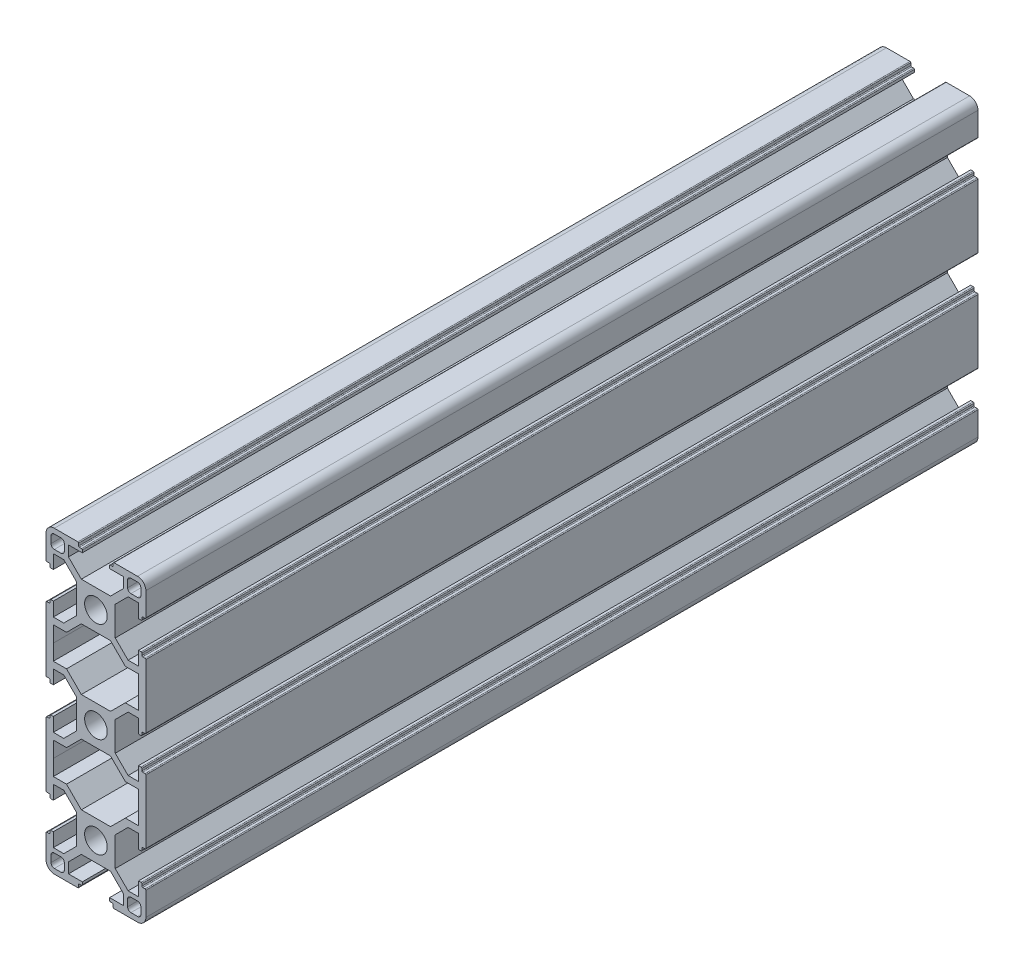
from build123d import *

# Parameters (mm, degrees)
BOSS_EXTRUDE1_DEPTH = 250
SKETCH2_R           = 3.4
CUT_EXTRUDE1_DEPTH  = 262.438329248
FILLET1_R           = 2.5
FILLET2_R           = 0.25


with BuildPart() as part:
    # Sketch1 → Boss-Extrude1 (new body)
    with BuildSketch(Plane.XY):
        Polygon((-15, 15), (-5.2, 15), (-5.2, 13.808325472), (-4.1, 13.808325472), (-4.1, 12.8), (-8.25, 12.8), (-8.25, 9.664213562), (-4.385786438, 5.8), (4.385786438, 5.8), (8.25, 9.664213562), (8.25, 12.8), (4.1, 12.8), (4.1, 13.808325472), (5.2, 13.808325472), (5.2, 15), (15, 15), (15, 5.2), (13.808325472, 5.2), (13.808325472, 4.1), (12.8, 4.1), (12.8, 8.25), (9.664213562, 8.25), (5.8, 4.385786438), (5.8, -4.385786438), (9.664213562, -8.25), (12.8, -8.25), (12.8, -4.1), (13.808325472, -4.1), (13.808325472, -5.2), (15, -5.2), (15, -24.8), (13.808325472, -24.8), (13.808325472, -25.9), (12.8, -25.9), (12.8, -21.75), (9.664213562, -21.75), (5.8, -25.614213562), (5.8, -34.385786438), (9.664213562, -38.25), (12.8, -38.25), (12.8, -34.1), (13.808325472, -34.1), (13.808325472, -35.2), (15, -35.2), (15, -54.8), (13.808325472, -54.8), (13.808325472, -55.9), (12.8, -55.9), (12.8, -51.75), (9.664213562, -51.75), (5.8, -55.614213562), (5.8, -64.385786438), (9.664213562, -68.25), (12.8, -68.25), (12.8, -64.1), (13.808325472, -64.1), (13.808325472, -65.2), (15, -65.2), (15, -75), (5.2, -75), (5.2, -73.808325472), (4.1, -73.808325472), (4.1, -72.8), (8.25, -72.8), (8.25, -69.664213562), (4.385786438, -65.8), (-4.385786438, -65.8), (-8.25, -69.664213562), (-8.25, -72.8), (-4.1, -72.8), (-4.1, -73.808325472), (-5.2, -73.808325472), (-5.2, -75), (-15, -75), (-15, -65.2), (-13.808325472, -65.2), (-13.808325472, -64.1), (-12.8, -64.1), (-12.8, -68.25), (-9.664213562, -68.25), (-5.8, -64.385786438), (-5.8, -55.614213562), (-9.664213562, -51.75), (-12.8, -51.75), (-12.8, -55.9), (-13.808325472, -55.9), (-13.808325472, -54.8), (-15, -54.8), (-15, -35.2), (-13.808325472, -35.2), (-13.808325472, -34.1), (-12.8, -34.1), (-12.8, -38.25), (-9.664213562, -38.25), (-5.8, -34.385786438), (-5.8, -25.614213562), (-9.664213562, -21.75), (-12.8, -21.75), (-12.8, -25.9), (-13.808325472, -25.9), (-13.808325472, -24.8), (-15, -24.8), (-15, -5.2), (-13.808325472, -5.2), (-13.808325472, -4.1), (-12.8, -4.1), (-12.8, -8.25), (-9.664213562, -8.25), (-5.8, -4.385786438), (-5.8, 4.385786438), (-9.664213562, 8.25), (-12.8, 8.25), (-12.8, 4.1), (-13.808325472, 4.1), (-13.808325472, 5.2), (-15, 5.2), align=None)
        Polygon((-4.385786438, -5.8), (-8.835786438, -10.25), (-12.8, -10.25), (-12.761838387, -15), (-12.8, -19.75), (-8.835786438, -19.75), (-4.385786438, -24.2), (4.385786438, -24.2), (8.835786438, -19.75), (12.8, -19.75), (12.761838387, -15), (12.8, -10.25), (8.835786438, -10.25), (4.385786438, -5.8), align=None, mode=Mode.SUBTRACT)
        Polygon((-4.385786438, -35.8), (4.385786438, -35.8), (8.835786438, -40.25), (12.8, -40.25), (12.761838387, -45), (12.8, -49.75), (8.835786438, -49.75), (4.385786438, -54.2), (-4.385786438, -54.2), (-8.835786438, -49.75), (-12.8, -49.75), (-12.761838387, -45), (-12.8, -40.25), (-8.835786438, -40.25), align=None, mode=Mode.SUBTRACT)
    extrude(amount=BOSS_EXTRUDE1_DEPTH)

    # Sketch2 → Cut-Extrude1 (cut, through all)
    with BuildSketch(Plane.XY.offset(250)):
        with Locations(Location((0, -30, 0), (0, 0, 180))):
            Circle(SKETCH2_R)
        with Locations(Location((0, -60, 0), (0, 0, 180))):
            Circle(SKETCH2_R)
        Circle(SKETCH2_R)
        with BuildLine():
            Line((-12.5, 13.5), (-10.5, 13.5))
            ThreePointArc((-10.5, 13.5), (-9.792893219, 13.207106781), (-9.5, 12.5))
            Line((-9.5, 12.5), (-9.5, 10.5))
            ThreePointArc((-9.5, 10.5), (-9.792893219, 9.792893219), (-10.5, 9.5))
            Line((-10.5, 9.5), (-12.5, 9.5))
            ThreePointArc((-12.5, 9.5), (-13.207106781, 9.792893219), (-13.5, 10.5))
            Line((-13.5, 10.5), (-13.5, 12.5))
            ThreePointArc((-13.5, 12.5), (-13.207106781, 13.207106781), (-12.5, 13.5))
        make_face()
        with BuildLine():
            Line((9.5, 12.5), (9.5, 10.5))
            ThreePointArc((9.5, 10.5), (9.792893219, 9.792893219), (10.5, 9.5))
            Line((10.5, 9.5), (12.5, 9.5))
            ThreePointArc((12.5, 9.5), (13.207106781, 9.792893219), (13.5, 10.5))
            Line((13.5, 10.5), (13.5, 12.5))
            ThreePointArc((13.5, 12.5), (13.207106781, 13.207106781), (12.5, 13.5))
            Line((12.5, 13.5), (10.5, 13.5))
            ThreePointArc((10.5, 13.5), (9.792893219, 13.207106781), (9.5, 12.5))
        make_face()
        with BuildLine():
            Line((12.5, -73.5), (10.5, -73.5))
            ThreePointArc((10.5, -73.5), (9.792893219, -73.207106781), (9.5, -72.5))
            Line((9.5, -72.5), (9.5, -70.5))
            ThreePointArc((9.5, -70.5), (9.792893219, -69.792893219), (10.5, -69.5))
            Line((10.5, -69.5), (12.5, -69.5))
            ThreePointArc((12.5, -69.5), (13.207106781, -69.792893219), (13.5, -70.5))
            Line((13.5, -70.5), (13.5, -72.5))
            ThreePointArc((13.5, -72.5), (13.207106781, -73.207106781), (12.5, -73.5))
        make_face()
        with BuildLine():
            Line((-9.5, -72.5), (-9.5, -70.5))
            ThreePointArc((-9.5, -70.5), (-9.792893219, -69.792893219), (-10.5, -69.5))
            Line((-10.5, -69.5), (-12.5, -69.5))
            ThreePointArc((-12.5, -69.5), (-13.207106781, -69.792893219), (-13.5, -70.5))
            Line((-13.5, -70.5), (-13.5, -72.5))
            ThreePointArc((-13.5, -72.5), (-13.207106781, -73.207106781), (-12.5, -73.5))
            Line((-12.5, -73.5), (-10.5, -73.5))
            ThreePointArc((-10.5, -73.5), (-9.792893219, -73.207106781), (-9.5, -72.5))
        make_face()
    extrude(amount=-CUT_EXTRUDE1_DEPTH, mode=Mode.SUBTRACT)

    # Fillet1
    fillet1_edges = [part.edges().sort_by_distance(p)[0] for p in [
        (-15, 15, 125),
        (15, 15, 125),
        (15, -75, 125),
        (-15, -75, 125),
    ]]
    fillet(fillet1_edges, radius=FILLET1_R)

    # Fillet2
    fillet2_edges = [part.edges().sort_by_distance(p)[0] for p in [
        (-13.808325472, 4.1, 125),
        (-13.808325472, 5.2, 125),
        (-15, 5.2, 125),
        (-5.2, 15, 125),
        (-5.2, 13.808325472, 125),
        (-4.1, 13.808325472, 125),
        (4.1, 13.808325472, 125),
        (5.2, 13.808325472, 125),
        (5.2, 15, 125),
        (15, 5.2, 125),
        (13.808325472, 5.2, 125),
        (13.808325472, 4.1, 125),
        (13.808325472, -4.1, 125),
        (13.808325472, -5.2, 125),
        (15, -5.2, 125),
        (15, -24.8, 125),
        (13.808325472, -24.8, 125),
        (13.808325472, -25.9, 125),
        (13.808325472, -34.1, 125),
        (13.808325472, -35.2, 125),
        (15, -35.2, 125),
        (15, -54.8, 125),
        (13.808325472, -54.8, 125),
        (13.808325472, -55.9, 125),
        (13.808325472, -64.1, 125),
        (13.808325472, -65.2, 125),
        (15, -65.2, 125),
        (5.2, -75, 125),
        (5.2, -73.808325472, 125),
        (4.1, -73.808325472, 125),
        (-4.1, -73.808325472, 125),
        (-5.2, -73.808325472, 125),
        (-5.2, -75, 125),
        (-15, -65.2, 125),
        (-13.808325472, -65.2, 125),
        (-13.808325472, -64.1, 125),
        (-13.808325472, -55.9, 125),
        (-13.808325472, -54.8, 125),
        (-15, -54.8, 125),
        (-15, -35.2, 125),
        (-13.808325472, -35.2, 125),
        (-13.808325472, -34.1, 125),
        (-13.808325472, -25.9, 125),
        (-13.808325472, -24.8, 125),
        (-15, -24.8, 125),
        (-15, -5.2, 125),
        (-13.808325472, -5.2, 125),
        (-13.808325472, -4.1, 125),
    ]]
    fillet(fillet2_edges, radius=FILLET2_R)


solid = part.part
